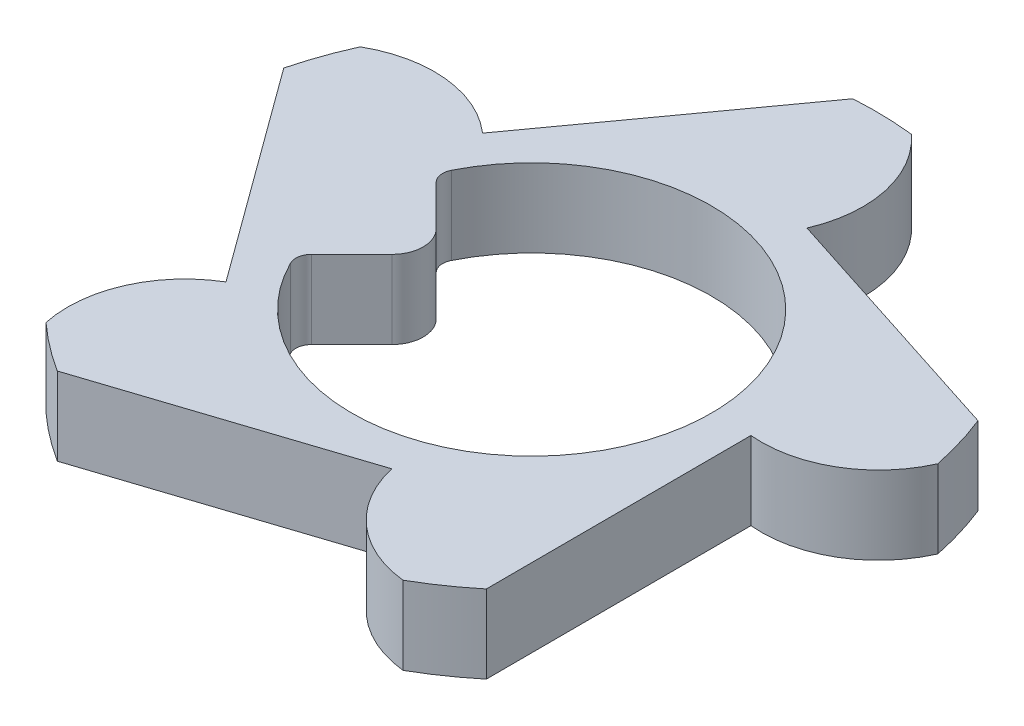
from build123d import *

# Parameters (mm, degrees)
BOSS_EXTRUDE1_DEPTH = 0.5
CUT_EXTRUDE1_REACH  = 5.12
FILLET1_R           = 0.1
FILLET2_R           = 0.2


with BuildPart() as part:
    # Sketch1 → Boss-Extrude1 (new body)
    with BuildSketch(Plane(origin=(0, 0, 0), x_dir=(1, 0, 0), z_dir=(0, 1, 0))):
        with BuildLine():
            Line((-1.130713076, -0.825522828), (-2.131397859, 0.545108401))
            ThreePointArc((-2.131397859, 0.545108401), (-2.07578756, 0.7287702), (-2.004384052, 0.906887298))
            ThreePointArc((-2.004384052, 0.906887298), (-1.555532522, 1.003410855), (-1.134528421, 0.820271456))
            Line((-1.134528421, 0.820271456), (-0.140209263, 2.195527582))
            ThreePointArc((-0.140209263, 2.195527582), (0.051648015, 2.199393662), (0.243112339, 2.186526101))
            ThreePointArc((0.243112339, 2.186526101), (0.473614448, 1.789470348), (0.42953595, 1.332478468))
            Line((0.42953595, 1.332478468), (2.044743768, 0.811802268))
            ThreePointArc((2.044743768, 0.811802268), (2.107707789, 0.630529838), (2.154635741, 0.444460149))
            ThreePointArc((2.154635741, 0.444460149), (1.848242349, 0.102542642), (1.399996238, 0.003245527))
            Line((1.399996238, 0.003245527), (1.40393041, -1.693806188))
            ThreePointArc((1.40393041, -1.693806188), (1.250987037, -1.809704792), (1.088525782, -1.911834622))
            ThreePointArc((1.088525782, -1.911834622), (0.668662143, -1.726095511), (0.435709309, -1.330472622))
            Line((0.435709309, -1.330472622), (-1.177067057, -1.858632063))
            ThreePointArc((-1.177067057, -1.858632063), (-1.33455528, -1.748988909), (-1.48188981, -1.626038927))
            ThreePointArc((-1.48188981, -1.626038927), (-1.434986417, -1.169328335), (-1.130713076, -0.825522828))
        make_face()
    extrude(amount=BOSS_EXTRUDE1_DEPTH)

    # Sketch2 → Cut-Extrude1 (cut, up to next)
    with BuildSketch(Plane(origin=(0, 0.5, 0), x_dir=(1, 0, 0), z_dir=(0, 1, 0)), mode=Mode.PRIVATE) as cut_extrude1_sk1:
        with BuildLine():
            Line((-1.059104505, 0.448104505), (-0.611, 0))
            Line((-0.611, 0), (-1.059104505, -0.448104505))
            ThreePointArc((-1.059104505, -0.448104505), (1.15, 0), (-1.059104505, 0.448104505))
        make_face()
    cut_extrude1_tool1 = extrude(cut_extrude1_sk1.sketch, amount=-CUT_EXTRUDE1_REACH, mode=Mode.PRIVATE) & part.part
    add(cut_extrude1_tool1.solids().sort_by_distance((0.062233, 0.5, 0))[0], mode=Mode.SUBTRACT)

    # Fillet1
    fillet1_edges = [part.edges().sort_by_distance(p)[0] for p in [
        (-1.059104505, 0.25, -0.448104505),
        (-1.059104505, 0.25, 0.448104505),
    ]]
    fillet(fillet1_edges, radius=FILLET1_R)

    # Fillet2
    fillet2_edges = [part.edges().sort_by_distance(p)[0] for p in [
        (-0.611, 0.25, 0),
    ]]
    fillet(fillet2_edges, radius=FILLET2_R)


solid = part.part
